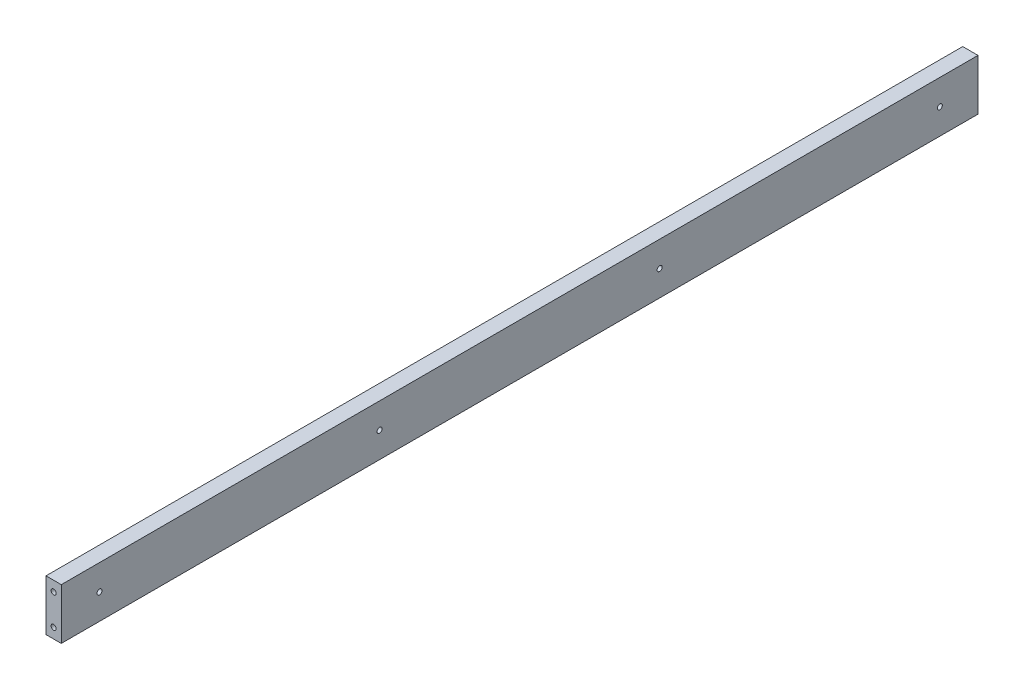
from build123d import *

# Parameters (mm, degrees)
ESQUISSE1_W                = 15
ESQUISSE1_H                = 50
EXTRUSION1_DEPTH           = 450
TROU_TARAUD_M61_AT_2_COUNT = 2
TROU_TARAUD_M61_AT_2_PITCH = 30
TROU_TARAUD_M62_D          = 5


with BuildPart() as part:
    # Esquisse1 → Extrusion1 (new, symmetric)
    with BuildSketch(Plane.XY):
        with Locations((7.5, 25)):
            Rectangle(ESQUISSE1_W, ESQUISSE1_H)
    extrude(amount=EXTRUSION1_DEPTH, both=True)

    # Esquisse2 → Trou taraud_ M61 (revolve, cut)
    with BuildSketch(Plane(origin=(7.5, 40, 450), x_dir=(0, -1, 0), z_dir=(1, 0, 0))):
        Polygon((0, 0), (0, 17.502151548), (2.5, 16), (2.5, 0), align=None)
    trou_taraud_m61 = revolve(axis=Axis((7.5, 40, 456.35), (0, 0, -1)), mode=Mode.SUBTRACT)

    # Trou taraud_ M61 at 2: Trou taraud_ M61 ×2
    with Locations(*[(0, -i * TROU_TARAUD_M61_AT_2_PITCH, 0) for i in range(1, TROU_TARAUD_M61_AT_2_COUNT)]):
        add(trou_taraud_m61, mode=Mode.SUBTRACT)

    # Sym_trie1: Trou taraud_ M61 across plane
    add(trou_taraud_m61.mirror(Plane.XY), mode=Mode.SUBTRACT)

    # Sym_trie1 copy 1 sketch → Sym_trie1 copy 1 (revolve, cut)
    with BuildSketch(Plane(origin=(7.5, 10, -450), x_dir=(0, -1, 0), z_dir=(1, 0, 0))):
        Polygon((0, 0), (0, -17.502151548), (2.5, -16), (2.5, 0), align=None)
    revolve(axis=Axis((7.5, 10, -456.35), (0, 0, -1)), mode=Mode.SUBTRACT)

    # Trou taraud_ M62 (through all)
    with Locations(Plane(origin=(15, 0, 0), x_dir=(0, 0, -1), z_dir=(1, 0, 0))):
        with Locations((137.5, 25), (-412.5, 25), (-137.5, 25), (412.5, 25)):
            Hole(TROU_TARAUD_M62_D / 2)


solid = part.part
